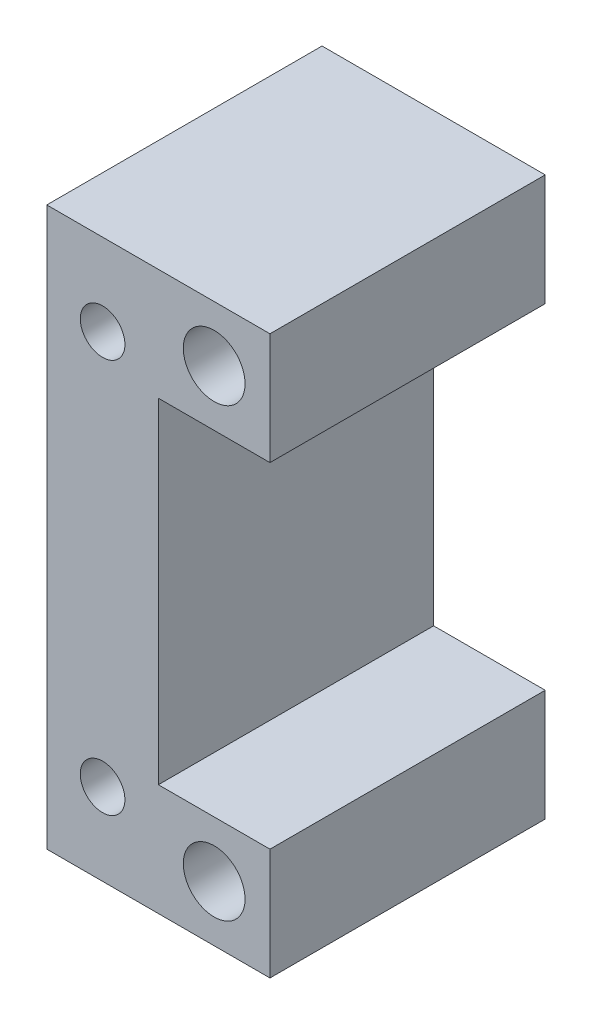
from build123d import *

# Parameters (mm, degrees)
BOSS_EXTRU_1_DEPTH      = 37
ESQUISSE2_R             = 3
ESQUISSE2_R_2           = 4.15
ENL_V_MAT_EXTRU_2_DEPTH = 37
ENL_V_MAT_EXTRU_6_DEPTH = 10


with BuildPart() as part:
    # Esquisse1 → Boss.-Extru.1 (new body)
    with BuildSketch(Plane.XY):
        Polygon((15, -75), (30, -75), (30, -60), (15, -60), (15, -15), (30, -15), (30, 0), (15, 0), (0, 0), (0, -75), align=None)
    extrude(amount=BOSS_EXTRU_1_DEPTH)

    # Esquisse2 → Enl_v. mat.-Extru.2 (cut)
    with BuildSketch(Plane.XY.offset(37)):
        with Locations((7.5, -11)):
            Circle(ESQUISSE2_R)
        with Locations((7.5, -64)):
            Circle(ESQUISSE2_R)
        with Locations((22.5, -7.5)):
            Circle(ESQUISSE2_R_2)
        with Locations((22.5, -67.5)):
            Circle(ESQUISSE2_R_2)
    extrude(amount=-ENL_V_MAT_EXTRU_2_DEPTH, mode=Mode.SUBTRACT)

    # Esquisse8 → Enl_v. mat.-Extru.6 (cut)
    with BuildSketch(Plane(origin=(0, 0, 0), x_dir=(-1, 0, 0), z_dir=(0, 0, -1))):
        Polygon((-7.5, -58.226497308), (-12.5, -61.113248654), (-12.5, -66.886751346), (-7.5, -69.773502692), (-2.5, -66.886751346), (-2.5, -61.113248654), align=None)
        Polygon((-7.5, -5.226497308), (-12.5, -8.113248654), (-12.5, -13.886751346), (-7.5, -16.773502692), (-2.5, -13.886751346), (-2.5, -8.113248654), align=None)
    extrude(amount=-ENL_V_MAT_EXTRU_6_DEPTH, mode=Mode.SUBTRACT)


solid = part.part
